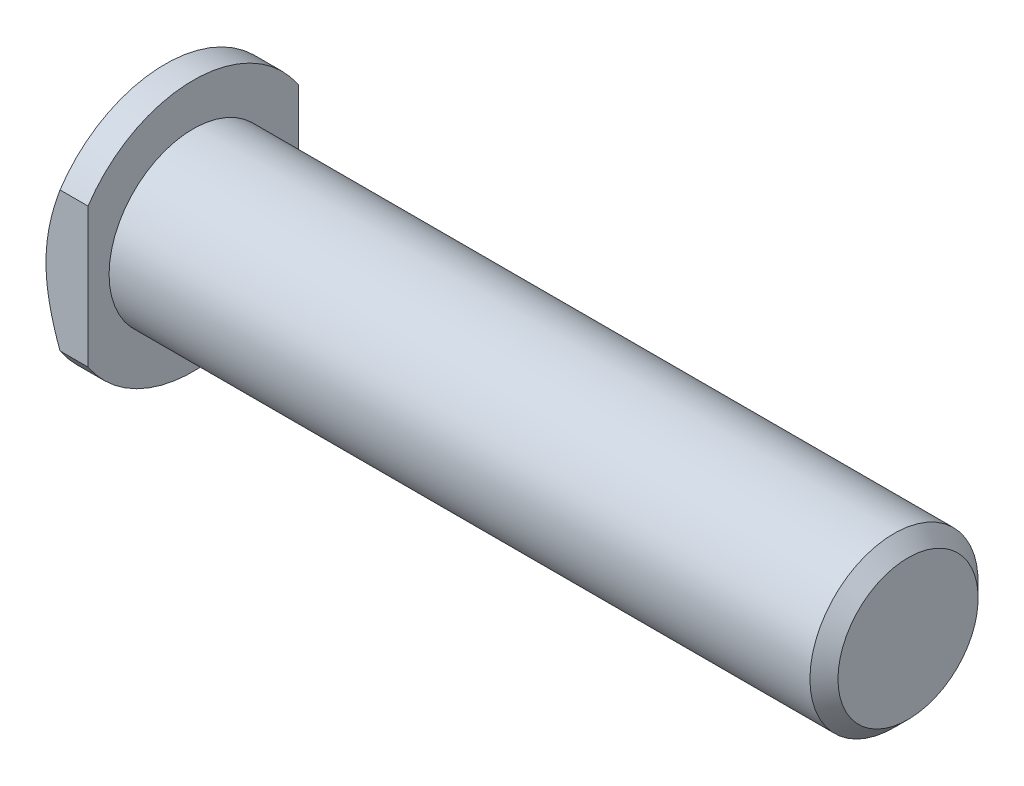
from build123d import *

# Parameters (mm, degrees)
CHANFREIN1_SIZE         = 4
CHANFREIN1_SIZE2        = 6
ESQUISSE2_W             = 14.514484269
ESQUISSE2_H             = 35.664161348
ENL_V_MAT_EXTRU_1_DEPTH = 8
CHANFREIN2_SIZE         = 2


with BuildPart() as part:
    # Esquisse1 → R_volution1 (revolve)
    with BuildSketch(Plane.XY, mode=Mode.PRIVATE) as r_volution1_sk:
        Polygon((0, 0), (110, 0), (110, 12), (8, 12), (8, 18), (0, 18), align=None)
    revolve(r_volution1_sk.sketch.rotate(Axis((0, 0, 0), (1, 0, 0)), 90), axis=Axis((0, 0, 0), (1, 0, 0)))

    # Chanfrein1
    chanfrein1_edges = [part.edges().sort_by_distance(p)[0] for p in [
        (0, 0, -18),
    ]]
    chanfrein1_side = [part.faces().sort_by_distance(p)[0] for p in [
        (4, 0, -18),
    ]]
    chamfer(chanfrein1_edges, length=CHANFREIN1_SIZE, length2=CHANFREIN1_SIZE2, reference=chanfrein1_side[0])

    # Esquisse2 → Enl_v. mat.-Extru.1 (cut)
    with BuildSketch(Plane.ZY):
        with Locations((-22.257242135, 0.023038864)):
            Rectangle(ESQUISSE2_W, ESQUISSE2_H)
    enl_v_mat_extru_1 = extrude(amount=-ENL_V_MAT_EXTRU_1_DEPTH, mode=Mode.SUBTRACT)

    # Sym_trie1: Enl_v. mat.-Extru.1 across plane
    add(enl_v_mat_extru_1.mirror(Plane.XY), mode=Mode.SUBTRACT)

    # Chanfrein2
    chanfrein2_edges = [part.edges().sort_by_distance(p)[0] for p in [
        (110, 0, -12),
    ]]
    chamfer(chanfrein2_edges, length=CHANFREIN2_SIZE)


solid = part.part
